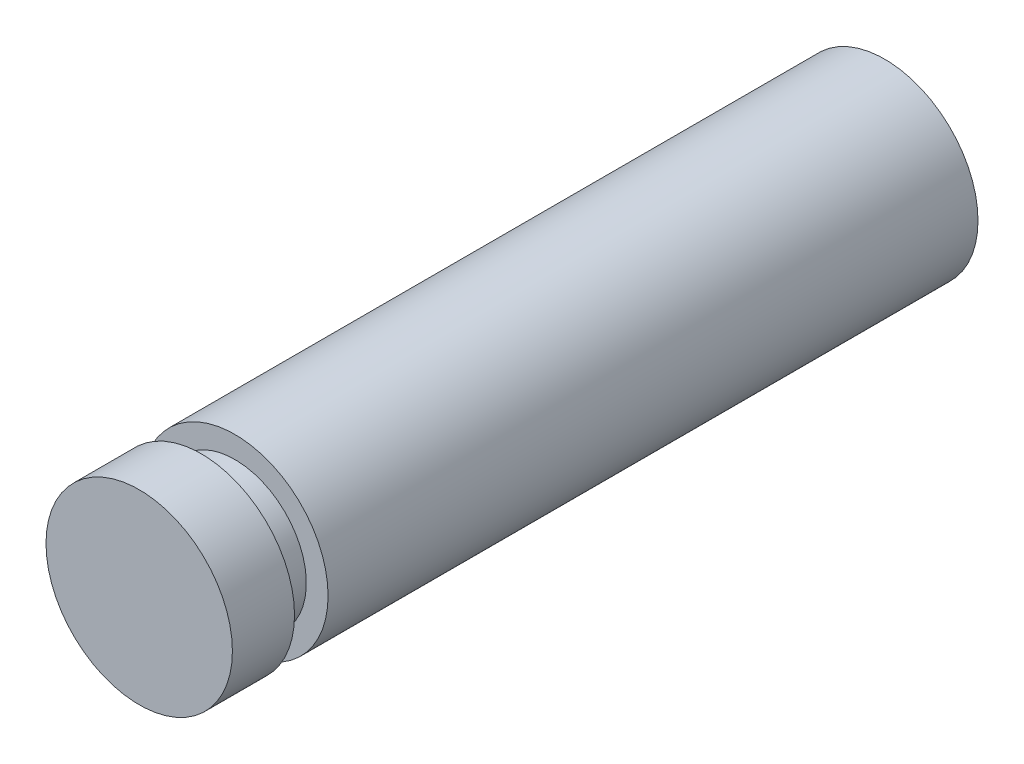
from build123d import *

# Parameters (mm, degrees)
ESQUISSE1_R        = 1.5
BOSS_EXTRU_1_DEPTH = 12
ESQUISSE2_W        = 0.951380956
ESQUISSE2_H        = 0.54


with BuildPart() as part:
    # Esquisse1 → Boss.-Extru.1 (new body)
    with BuildSketch(Plane.XY):
        Circle(ESQUISSE1_R)
    extrude(amount=BOSS_EXTRU_1_DEPTH)

    # Esquisse2 → Enl_vement de mati_re-R_volution1 (revolve, cut)
    with BuildSketch(Plane(origin=(0, 0, 0), x_dir=(1, 0, 0), z_dir=(0, 1, 0)), mode=Mode.PRIVATE) as enl_vement_de_mati_re_r_volution1_sk:
        with Locations((1.625690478, -10.73)):
            Rectangle(ESQUISSE2_W, ESQUISSE2_H)
    revolve(enl_vement_de_mati_re_r_volution1_sk.sketch.rotate(Axis((0, 0, -1.007208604), (0, 0, 1)), 180), axis=Axis((0, 0, -1.007208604), (0, 0, 1)), mode=Mode.SUBTRACT)


solid = part.part
